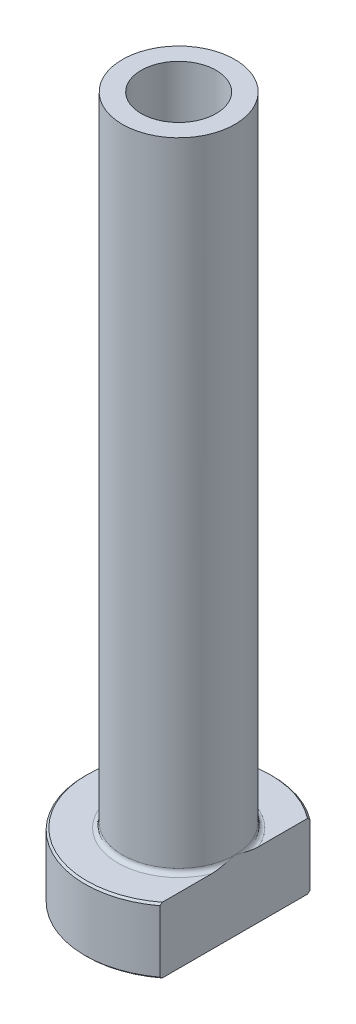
ISO-10303-21;
HEADER;
FILE_DESCRIPTION(('STEP AP214'),'2;1');
FILE_NAME('part.step','',(''),(''),'','','');
FILE_SCHEMA(('AUTOMOTIVE_DESIGN { 1 0 10303 214 1 1 1 1 }'));
ENDSEC;
DATA;
#1=APPLICATION_CONTEXT('core data for automotive mechanical design processes');
#2=APPLICATION_PROTOCOL_DEFINITION('international standard','automotive_design',2000,#1);
#3=PRODUCT_CONTEXT('',#1,'mechanical');
#4=PRODUCT('Part','Part','',(#3));
#5=PRODUCT_RELATED_PRODUCT_CATEGORY('part','',(#4));
#6=PRODUCT_DEFINITION_FORMATION('','',#4);
#7=PRODUCT_DEFINITION_CONTEXT('part definition',#1,'design');
#8=PRODUCT_DEFINITION('design','',#6,#7);
#9=PRODUCT_DEFINITION_SHAPE('','',#8);
#10=(LENGTH_UNIT() NAMED_UNIT(*) SI_UNIT(.MILLI.,.METRE.));
#11=(NAMED_UNIT(*) PLANE_ANGLE_UNIT() SI_UNIT($,.RADIAN.));
#12=(NAMED_UNIT(*) SI_UNIT($,.STERADIAN.) SOLID_ANGLE_UNIT());
#13=UNCERTAINTY_MEASURE_WITH_UNIT(LENGTH_MEASURE(1.E-05),#10,'distance_accuracy_value','');
#14=(GEOMETRIC_REPRESENTATION_CONTEXT(3) GLOBAL_UNCERTAINTY_ASSIGNED_CONTEXT((#13)) GLOBAL_UNIT_ASSIGNED_CONTEXT((#10,
#11,#12)) REPRESENTATION_CONTEXT('',''));
#15=CARTESIAN_POINT('',(0.,0.,0.));
#16=DIRECTION('',(0.,0.,1.));
#17=DIRECTION('',(1.,0.,0.));
#18=AXIS2_PLACEMENT_3D('',#15,#16,#17);
#19=CARTESIAN_POINT('',(0.,92.1876809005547,0.));
#20=DIRECTION('',(0.,1.,0.));
#21=DIRECTION('',(0.,0.,1.));
#22=AXIS2_PLACEMENT_3D('',#19,#20,#21);
#23=CYLINDRICAL_SURFACE('',#22,4.00000000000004);
#24=CARTESIAN_POINT('',(0.,75.,0.));
#25=DIRECTION('',(0.,1.,0.));
#26=DIRECTION('',(0.,0.,1.));
#27=AXIS2_PLACEMENT_3D('',#24,#25,#26);
#28=CIRCLE('',#27,4.00000000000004);
#29=CARTESIAN_POINT('',(0.,75.,4.00000000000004));
#30=VERTEX_POINT('',#29);
#31=EDGE_CURVE('E167',#30,#30,#28,.T.);
#32=ORIENTED_EDGE('',*,*,#31,.T.);
#33=EDGE_LOOP('',(#32));
#34=FACE_BOUND('',#33,.T.);
#35=CARTESIAN_POINT('',(0.,30.,0.));
#36=DIRECTION('',(0.,1.,0.));
#37=DIRECTION('',(0.,0.,1.));
#38=AXIS2_PLACEMENT_3D('',#35,#36,#37);
#39=CIRCLE('',#38,4.00000000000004);
#40=CARTESIAN_POINT('',(0.,30.,4.00000000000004));
#41=VERTEX_POINT('',#40);
#42=EDGE_CURVE('E170',#41,#41,#39,.T.);
#43=ORIENTED_EDGE('',*,*,#42,.F.);
#44=EDGE_LOOP('',(#43));
#45=FACE_BOUND('',#44,.T.);
#46=ADVANCED_FACE('F32',(#34,#45),#23,.F.);
#47=CARTESIAN_POINT('',(-4.00000000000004,75.,0.));
#48=DIRECTION('',(0.,1.,0.));
#49=DIRECTION('',(0.,0.,1.));
#50=AXIS2_PLACEMENT_3D('',#47,#48,#49);
#51=PLANE('',#50);
#52=CARTESIAN_POINT('',(0.,75.,0.));
#53=DIRECTION('',(0.,1.,0.));
#54=DIRECTION('',(0.,0.,1.));
#55=AXIS2_PLACEMENT_3D('',#52,#53,#54);
#56=CIRCLE('',#55,6.);
#57=CARTESIAN_POINT('',(0.,75.,6.));
#58=VERTEX_POINT('',#57);
#59=EDGE_CURVE('E174',#58,#58,#56,.T.);
#60=ORIENTED_EDGE('',*,*,#59,.T.);
#61=EDGE_LOOP('',(#60));
#62=FACE_BOUND('',#61,.T.);
#63=ORIENTED_EDGE('',*,*,#31,.F.);
#64=EDGE_LOOP('',(#63));
#65=FACE_BOUND('',#64,.T.);
#66=ADVANCED_FACE('F157',(#62,#65),#51,.T.);
#67=CARTESIAN_POINT('',(0.,92.1876809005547,0.));
#68=DIRECTION('',(0.,1.,0.));
#69=DIRECTION('',(0.,0.,1.));
#70=AXIS2_PLACEMENT_3D('',#67,#68,#69);
#71=CYLINDRICAL_SURFACE('',#70,5.99999999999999);
#72=CARTESIAN_POINT('',(0.,7.50000000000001,0.));
#73=DIRECTION('',(0.,1.,0.));
#74=DIRECTION('',(0.,0.,1.));
#75=AXIS2_PLACEMENT_3D('',#72,#73,#74);
#76=CIRCLE('',#75,5.99999999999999);
#77=CARTESIAN_POINT('',(5.99999999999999,7.50000000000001,0.));
#78=VERTEX_POINT('',#77);
#79=EDGE_CURVE('E180',#78,#78,#76,.T.);
#80=ORIENTED_EDGE('',*,*,#79,.T.);
#81=EDGE_LOOP('',(#80));
#82=FACE_BOUND('',#81,.T.);
#83=ORIENTED_EDGE('',*,*,#59,.F.);
#84=EDGE_LOOP('',(#83));
#85=FACE_BOUND('',#84,.T.);
#86=ADVANCED_FACE('F162',(#82,#85),#71,.T.);
#87=CARTESIAN_POINT('',(-5.99999999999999,7.,0.));
#88=DIRECTION('',(0.,1.,0.));
#89=DIRECTION('',(0.,0.,1.));
#90=AXIS2_PLACEMENT_3D('',#87,#88,#89);
#91=PLANE('',#90);
#92=DIRECTION('',(0.,0.,1.));
#93=VECTOR('',#92,1.);
#94=CARTESIAN_POINT('',(6.,7.,0.));
#95=LINE('',#94,#93);
#96=CARTESIAN_POINT('',(6.,7.,-7.74854825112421));
#97=VERTEX_POINT('',#96);
#98=CARTESIAN_POINT('',(6.,7.,-2.49999999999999));
#99=VERTEX_POINT('',#98);
#100=EDGE_CURVE('E54',#97,#99,#95,.T.);
#101=ORIENTED_EDGE('',*,*,#100,.F.);
#102=CARTESIAN_POINT('',(0.,7.,0.));
#103=DIRECTION('',(0.,1.,0.));
#104=DIRECTION('',(0.,0.,1.));
#105=AXIS2_PLACEMENT_3D('',#102,#103,#104);
#106=CIRCLE('',#105,9.8);
#107=CARTESIAN_POINT('',(5.99999999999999,7.,7.74854825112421));
#108=VERTEX_POINT('',#107);
#109=EDGE_CURVE('E186',#97,#108,#106,.T.);
#110=ORIENTED_EDGE('',*,*,#109,.T.);
#111=CARTESIAN_POINT('',(6.,7.,2.49999999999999));
#112=VERTEX_POINT('',#111);
#113=EDGE_CURVE('E134',#112,#108,#95,.T.);
#114=ORIENTED_EDGE('',*,*,#113,.F.);
#115=CARTESIAN_POINT('',(0.,7.,0.));
#116=DIRECTION('',(0.,1.,0.));
#117=DIRECTION('',(0.,0.,1.));
#118=AXIS2_PLACEMENT_3D('',#115,#116,#117);
#119=CIRCLE('',#118,6.49999999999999);
#120=EDGE_CURVE('E183',#112,#99,#119,.F.);
#121=ORIENTED_EDGE('',*,*,#120,.T.);
#122=EDGE_LOOP('',(#101,#110,#114,#121));
#123=FACE_BOUND('',#122,.T.);
#124=ADVANCED_FACE('F197',(#123),#91,.T.);
#125=CARTESIAN_POINT('',(0.,92.1876809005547,0.));
#126=DIRECTION('',(0.,1.,0.));
#127=DIRECTION('',(0.,0.,1.));
#128=AXIS2_PLACEMENT_3D('',#125,#126,#127);
#129=CYLINDRICAL_SURFACE('',#128,9.99999999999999);
#130=DIRECTION('',(0.,-1.,0.));
#131=VECTOR('',#130,1.);
#132=CARTESIAN_POINT('',(5.99999999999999,75.,7.99999999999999));
#133=LINE('',#132,#131);
#134=CARTESIAN_POINT('',(5.99999999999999,6.8,7.99999999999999));
#135=VERTEX_POINT('',#134);
#136=CARTESIAN_POINT('',(5.99999999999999,0.200000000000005,7.99999999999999));
#137=VERTEX_POINT('',#136);
#138=EDGE_CURVE('E82',#135,#137,#133,.T.);
#139=ORIENTED_EDGE('',*,*,#138,.F.);
#140=CARTESIAN_POINT('',(0.,6.8,0.));
#141=DIRECTION('',(0.,1.,0.));
#142=DIRECTION('',(0.,0.,1.));
#143=AXIS2_PLACEMENT_3D('',#140,#141,#142);
#144=CIRCLE('',#143,9.99999999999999);
#145=CARTESIAN_POINT('',(6.,6.8,-7.99999999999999));
#146=VERTEX_POINT('',#145);
#147=EDGE_CURVE('E95',#135,#146,#144,.F.);
#148=ORIENTED_EDGE('',*,*,#147,.T.);
#149=DIRECTION('',(0.,-1.,0.));
#150=VECTOR('',#149,1.);
#151=CARTESIAN_POINT('',(6.,75.,-7.99999999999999));
#152=LINE('',#151,#150);
#153=CARTESIAN_POINT('',(6.,0.200000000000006,-7.99999999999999));
#154=VERTEX_POINT('',#153);
#155=EDGE_CURVE('E192',#146,#154,#152,.T.);
#156=ORIENTED_EDGE('',*,*,#155,.T.);
#157=CARTESIAN_POINT('',(0.,0.200000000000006,0.));
#158=DIRECTION('',(0.,-1.,0.));
#159=DIRECTION('',(0.,0.,-1.));
#160=AXIS2_PLACEMENT_3D('',#157,#158,#159);
#161=CIRCLE('',#160,9.99999999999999);
#162=EDGE_CURVE('E98',#154,#137,#161,.F.);
#163=ORIENTED_EDGE('',*,*,#162,.T.);
#164=EDGE_LOOP('',(#139,#148,#156,#163));
#165=FACE_BOUND('',#164,.T.);
#166=ADVANCED_FACE('F190',(#165),#129,.T.);
#167=CARTESIAN_POINT('',(-9.99999999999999,0.,0.));
#168=DIRECTION('',(0.,-1.,0.));
#169=DIRECTION('',(0.,0.,-1.));
#170=AXIS2_PLACEMENT_3D('',#167,#168,#169);
#171=PLANE('',#170);
#172=CARTESIAN_POINT('',(0.,0.,0.));
#173=DIRECTION('',(0.,-1.,0.));
#174=DIRECTION('',(0.,0.,-1.));
#175=AXIS2_PLACEMENT_3D('',#172,#173,#174);
#176=CIRCLE('',#175,4.74999999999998);
#177=CARTESIAN_POINT('',(0.,0.,-4.74999999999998));
#178=VERTEX_POINT('',#177);
#179=EDGE_CURVE('E40',#178,#178,#176,.F.);
#180=ORIENTED_EDGE('',*,*,#179,.T.);
#181=EDGE_LOOP('',(#180));
#182=FACE_BOUND('',#181,.T.);
#183=DIRECTION('',(0.,0.,-1.));
#184=VECTOR('',#183,1.);
#185=CARTESIAN_POINT('',(5.99999999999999,0.,7.99999999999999));
#186=LINE('',#185,#184);
#187=CARTESIAN_POINT('',(5.99999999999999,0.,7.74854825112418));
#188=VERTEX_POINT('',#187);
#189=CARTESIAN_POINT('',(6.,0.,-7.74854825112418));
#190=VERTEX_POINT('',#189);
#191=EDGE_CURVE('E47',#188,#190,#186,.T.);
#192=ORIENTED_EDGE('',*,*,#191,.F.);
#193=CARTESIAN_POINT('',(0.,0.,0.));
#194=DIRECTION('',(0.,-1.,0.));
#195=DIRECTION('',(0.,0.,-1.));
#196=AXIS2_PLACEMENT_3D('',#193,#194,#195);
#197=CIRCLE('',#196,9.79999999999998);
#198=EDGE_CURVE('E92',#188,#190,#197,.T.);
#199=ORIENTED_EDGE('',*,*,#198,.T.);
#200=EDGE_LOOP('',(#192,#199));
#201=FACE_BOUND('',#200,.T.);
#202=ADVANCED_FACE('F91',(#182,#201),#171,.T.);
#203=CARTESIAN_POINT('',(0.,92.1876809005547,0.));
#204=DIRECTION('',(0.,1.,0.));
#205=DIRECTION('',(0.,0.,1.));
#206=AXIS2_PLACEMENT_3D('',#203,#204,#205);
#207=CYLINDRICAL_SURFACE('',#206,4.24999999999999);
#208=CARTESIAN_POINT('',(0.,0.499999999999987,0.));
#209=DIRECTION('',(0.,-1.,0.));
#210=DIRECTION('',(0.,0.,-1.));
#211=AXIS2_PLACEMENT_3D('',#208,#209,#210);
#212=CIRCLE('',#211,4.24999999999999);
#213=CARTESIAN_POINT('',(0.,0.499999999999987,-4.24999999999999));
#214=VERTEX_POINT('',#213);
#215=EDGE_CURVE('E11',#214,#214,#212,.T.);
#216=ORIENTED_EDGE('',*,*,#215,.T.);
#217=EDGE_LOOP('',(#216));
#218=FACE_BOUND('',#217,.T.);
#219=CARTESIAN_POINT('',(0.,18.,0.));
#220=DIRECTION('',(0.,1.,0.));
#221=DIRECTION('',(0.,0.,1.));
#222=AXIS2_PLACEMENT_3D('',#219,#220,#221);
#223=CIRCLE('',#222,4.24999999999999);
#224=CARTESIAN_POINT('',(0.,18.,4.24999999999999));
#225=VERTEX_POINT('',#224);
#226=EDGE_CURVE('E172',#225,#225,#223,.T.);
#227=ORIENTED_EDGE('',*,*,#226,.T.);
#228=EDGE_LOOP('',(#227));
#229=FACE_BOUND('',#228,.T.);
#230=ADVANCED_FACE('F215',(#218,#229),#207,.F.);
#231=CARTESIAN_POINT('',(0.,18.,0.));
#232=DIRECTION('',(0.,-1.,0.));
#233=DIRECTION('',(0.,0.,-1.));
#234=AXIS2_PLACEMENT_3D('',#231,#232,#233);
#235=CONICAL_SURFACE('',#234,4.24999999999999,0.0208303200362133);
#236=ORIENTED_EDGE('',*,*,#42,.T.);
#237=EDGE_LOOP('',(#236));
#238=FACE_BOUND('',#237,.T.);
#239=ORIENTED_EDGE('',*,*,#226,.F.);
#240=EDGE_LOOP('',(#239));
#241=FACE_BOUND('',#240,.T.);
#242=ADVANCED_FACE('F111',(#238,#241),#235,.F.);
#243=CARTESIAN_POINT('',(0.,7.50000000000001,0.));
#244=DIRECTION('',(0.,1.,0.));
#245=DIRECTION('',(0.,0.,1.));
#246=AXIS2_PLACEMENT_3D('',#243,#244,#245);
#247=TOROIDAL_SURFACE('',#246,6.49999999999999,0.5);
#248=ORIENTED_EDGE('',*,*,#120,.F.);
#249=CARTESIAN_POINT('',(5.99999999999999,7.50000000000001,0.));
#250=CARTESIAN_POINT('',(5.99999999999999,7.50000080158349,6.70442402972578E-11));
#251=CARTESIAN_POINT('',(5.99999999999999,7.50000160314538,2.62462545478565E-07));
#252=CARTESIAN_POINT('',(5.99999999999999,7.50000311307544,1.01907161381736E-06));
#253=CARTESIAN_POINT('',(5.99999999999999,7.50000381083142,1.52837897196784E-06));
#254=CARTESIAN_POINT('',(5.99999999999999,7.50000523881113,2.74467568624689E-06));
#255=CARTESIAN_POINT('',(5.99999999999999,7.50000595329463,3.47066670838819E-06));
#256=CARTESIAN_POINT('',(5.99999999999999,7.50000725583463,4.99336121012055E-06));
#257=CARTESIAN_POINT('',(5.99999999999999,7.50000784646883,5.7880006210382E-06));
#258=CARTESIAN_POINT('',(5.99999999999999,7.5000099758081,8.79661487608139E-06));
#259=CARTESIAN_POINT('',(5.99999999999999,7.5000113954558,1.10980660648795E-05));
#260=CARTESIAN_POINT('',(5.99999999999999,7.50001378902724,1.57116080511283E-05));
#261=CARTESIAN_POINT('',(5.99999999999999,7.50001478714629,1.80117429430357E-05));
#262=CARTESIAN_POINT('',(5.99999999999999,7.50001885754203,2.75423816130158E-05));
#263=CARTESIAN_POINT('',(5.99999999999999,7.50002181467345,3.48285051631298E-05));
#264=CARTESIAN_POINT('',(5.99999999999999,7.50002628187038,4.87408364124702E-05));
#265=CARTESIAN_POINT('',(5.99999999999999,7.50002793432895,5.53214351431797E-05));
#266=CARTESIAN_POINT('',(5.99999999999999,7.50003978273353,0.000103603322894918));
#267=CARTESIAN_POINT('',(6.,7.50004857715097,0.000145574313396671));
#268=CARTESIAN_POINT('',(6.,7.50008704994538,0.000310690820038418));
#269=CARTESIAN_POINT('',(6.,7.50012394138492,0.000432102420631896));
#270=CARTESIAN_POINT('',(5.99999999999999,7.50026686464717,0.000911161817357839));
#271=CARTESIAN_POINT('',(5.99999999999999,7.50036807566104,0.0012698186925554));
#272=CARTESIAN_POINT('',(6.,7.50077195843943,0.00268961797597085));
#273=CARTESIAN_POINT('',(6.,7.50108058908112,0.0037494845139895));
#274=CARTESIAN_POINT('',(5.99999999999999,7.50236320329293,0.00816658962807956));
#275=CARTESIAN_POINT('',(5.99999999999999,7.50332976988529,0.0115254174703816));
#276=CARTESIAN_POINT('',(6.00000000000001,7.51709821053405,0.0593544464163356));
#277=CARTESIAN_POINT('',(6.,7.52995465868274,0.103813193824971));
#278=CARTESIAN_POINT('',(5.99999999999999,7.55506029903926,0.190977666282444));
#279=CARTESIAN_POINT('',(5.99999999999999,7.56731321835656,0.233682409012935));
#280=CARTESIAN_POINT('',(6.,7.5932566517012,0.324512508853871));
#281=CARTESIAN_POINT('',(6.,7.60693346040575,0.372641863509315));
#282=CARTESIAN_POINT('',(6.,7.63422038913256,0.469489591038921));
#283=CARTESIAN_POINT('',(6.,7.64782813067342,0.518208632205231));
#284=CARTESIAN_POINT('',(6.,7.68043734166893,0.636338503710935));
#285=CARTESIAN_POINT('',(6.,7.69928754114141,0.705791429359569));
#286=CARTESIAN_POINT('',(6.,7.73566887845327,0.84310273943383));
#287=CARTESIAN_POINT('',(6.,7.75322160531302,0.910955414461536));
#288=CARTESIAN_POINT('',(6.,7.80024878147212,1.0985743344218));
#289=CARTESIAN_POINT('',(6.,7.8286490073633,1.21861610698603));
#290=CARTESIAN_POINT('',(6.,7.88105633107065,1.46081534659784));
#291=CARTESIAN_POINT('',(6.,7.90502088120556,1.58298212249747));
#292=CARTESIAN_POINT('',(6.,7.94810499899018,1.83866408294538));
#293=CARTESIAN_POINT('',(6.,7.96665856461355,1.97228081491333));
#294=CARTESIAN_POINT('',(6.,7.98621697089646,2.17329578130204));
#295=CARTESIAN_POINT('',(6.,7.99135613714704,2.24029152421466));
#296=CARTESIAN_POINT('',(6.,7.99832928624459,2.37444824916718));
#297=CARTESIAN_POINT('',(6.,8.00016429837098,2.44160917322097));
#298=CARTESIAN_POINT('',(6.,7.99984674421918,2.56298631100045));
#299=CARTESIAN_POINT('',(6.,7.99839439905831,2.61720324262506));
#300=CARTESIAN_POINT('',(6.,7.99236557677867,2.72552036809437));
#301=CARTESIAN_POINT('',(6.,7.98778645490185,2.77962042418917));
#302=CARTESIAN_POINT('',(6.,7.97492915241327,2.88664710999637));
#303=CARTESIAN_POINT('',(6.,7.9667026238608,2.93957965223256));
#304=CARTESIAN_POINT('',(6.,7.94570253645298,3.04448333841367));
#305=CARTESIAN_POINT('',(6.,7.93293488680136,3.09645563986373));
#306=CARTESIAN_POINT('',(6.,7.90135968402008,3.19943606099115));
#307=CARTESIAN_POINT('',(6.,7.88247175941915,3.25042120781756));
#308=CARTESIAN_POINT('',(6.,7.84818685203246,3.32403783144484));
#309=CARTESIAN_POINT('',(6.,7.83579052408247,3.34806431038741));
#310=CARTESIAN_POINT('',(6.,7.80866016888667,3.39474488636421));
#311=CARTESIAN_POINT('',(6.,7.79392968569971,3.41740099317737));
#312=CARTESIAN_POINT('',(6.,7.76577135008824,3.45524173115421));
#313=CARTESIAN_POINT('',(6.,7.75294719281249,3.47087266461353));
#314=CARTESIAN_POINT('',(6.,7.7255631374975,3.50058040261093));
#315=CARTESIAN_POINT('',(6.,7.71100204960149,3.51465612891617));
#316=CARTESIAN_POINT('',(6.,7.67984897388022,3.54077006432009));
#317=CARTESIAN_POINT('',(6.,7.66323651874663,3.55278430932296));
#318=CARTESIAN_POINT('',(6.,7.62815222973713,3.57370259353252));
#319=CARTESIAN_POINT('',(6.,7.60968501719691,3.58261412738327));
#320=CARTESIAN_POINT('',(6.,7.57639898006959,3.59454653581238));
#321=CARTESIAN_POINT('',(6.,7.56191673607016,3.59850385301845));
#322=CARTESIAN_POINT('',(6.,7.53249228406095,3.60392336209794));
#323=CARTESIAN_POINT('',(6.,7.5175504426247,3.60538749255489));
#324=CARTESIAN_POINT('',(6.,7.48761833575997,3.60568912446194));
#325=CARTESIAN_POINT('',(6.,7.47262803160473,3.6045228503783));
#326=CARTESIAN_POINT('',(6.,7.44306278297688,3.59966500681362));
#327=CARTESIAN_POINT('',(6.,7.42848812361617,3.59597174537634));
#328=CARTESIAN_POINT('',(6.,7.39702156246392,3.58531109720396));
#329=CARTESIAN_POINT('',(6.,7.38031267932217,3.57780732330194));
#330=CARTESIAN_POINT('',(6.,7.34834450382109,3.56018434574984));
#331=CARTESIAN_POINT('',(6.,7.33308764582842,3.55006085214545));
#332=CARTESIAN_POINT('',(6.,7.29715308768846,3.52252389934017));
#333=CARTESIAN_POINT('',(6.,7.27737832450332,3.50394102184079));
#334=CARTESIAN_POINT('',(6.,7.24088410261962,3.46399503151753));
#335=CARTESIAN_POINT('',(6.,7.22417302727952,3.44262455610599));
#336=CARTESIAN_POINT('',(6.,7.18148338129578,3.38088102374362));
#337=CARTESIAN_POINT('',(6.,7.15831783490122,3.33858120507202));
#338=CARTESIAN_POINT('',(6.,7.11822747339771,3.25128083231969));
#339=CARTESIAN_POINT('',(6.,7.10130560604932,3.20627901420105));
#340=CARTESIAN_POINT('',(6.,7.0719338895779,3.11375892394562));
#341=CARTESIAN_POINT('',(6.,7.05959256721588,3.06620687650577));
#342=CARTESIAN_POINT('',(6.,7.03888782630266,2.97022063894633));
#343=CARTESIAN_POINT('',(6.,7.03052890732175,2.92178551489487));
#344=CARTESIAN_POINT('',(6.,7.01697563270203,2.82374574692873));
#345=CARTESIAN_POINT('',(6.,7.01183067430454,2.77413446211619));
#346=CARTESIAN_POINT('',(6.,7.00435015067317,2.67475263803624));
#347=CARTESIAN_POINT('',(6.,7.00201229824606,2.62498226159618));
#348=CARTESIAN_POINT('',(6.,6.99897190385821,2.49377014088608));
#349=CARTESIAN_POINT('',(6.,7.00025005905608,2.41228296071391));
#350=CARTESIAN_POINT('',(6.,7.00775652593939,2.2495213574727));
#351=CARTESIAN_POINT('',(6.,7.01398784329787,2.16824709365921));
#352=CARTESIAN_POINT('',(6.,7.03045087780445,2.00575531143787));
#353=CARTESIAN_POINT('',(6.,7.04070001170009,1.92453960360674));
#354=CARTESIAN_POINT('',(6.,7.06442774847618,1.76257601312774));
#355=CARTESIAN_POINT('',(6.,7.07790697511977,1.68182822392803));
#356=CARTESIAN_POINT('',(6.,7.11973611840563,1.45394312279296));
#357=CARTESIAN_POINT('',(6.,7.151138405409,1.30736987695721));
#358=CARTESIAN_POINT('',(6.,7.21927147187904,1.01717316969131));
#359=CARTESIAN_POINT('',(6.,7.25594155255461,0.873534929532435));
#360=CARTESIAN_POINT('',(6.,7.30765759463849,0.680321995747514));
#361=CARTESIAN_POINT('',(6.,7.32124979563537,0.63035125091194));
#362=CARTESIAN_POINT('',(6.,7.34913735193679,0.529103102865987));
#363=CARTESIAN_POINT('',(6.,7.36344174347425,0.477828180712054));
#364=CARTESIAN_POINT('',(6.,7.38809313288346,0.390268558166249));
#365=CARTESIAN_POINT('',(6.,7.39837954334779,0.353966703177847));
#366=CARTESIAN_POINT('',(6.,7.41893445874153,0.281778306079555));
#367=CARTESIAN_POINT('',(6.,7.42920197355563,0.245891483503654));
#368=CARTESIAN_POINT('',(5.99999999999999,7.44864004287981,0.178137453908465));
#369=CARTESIAN_POINT('',(5.99999999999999,7.4578051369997,0.14626862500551));
#370=CARTESIAN_POINT('',(6.,7.47656016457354,0.081230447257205));
#371=CARTESIAN_POINT('',(6.,7.48615204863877,0.0480615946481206));
#372=CARTESIAN_POINT('',(5.99999999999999,7.4966696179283,0.0115277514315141));
#373=CARTESIAN_POINT('',(5.99999999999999,7.49763547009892,0.00817123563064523));
#374=CARTESIAN_POINT('',(6.,7.49891791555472,0.00375466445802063));
#375=CARTESIAN_POINT('',(6.,7.49922706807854,0.00269301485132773));
#376=CARTESIAN_POINT('',(5.99999999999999,7.49963158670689,0.0012709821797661));
#377=CARTESIAN_POINT('',(5.99999999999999,7.49973292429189,0.000911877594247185));
#378=CARTESIAN_POINT('',(6.,7.49987600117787,0.000432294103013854));
#379=CARTESIAN_POINT('',(6.,7.49991291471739,0.000310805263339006));
#380=CARTESIAN_POINT('',(6.,7.49995140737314,0.000145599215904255));
#381=CARTESIAN_POINT('',(5.99999999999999,7.49996020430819,0.000103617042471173));
#382=CARTESIAN_POINT('',(5.99999999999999,7.4999720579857,5.53238180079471E-05));
#383=CARTESIAN_POINT('',(5.99999999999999,7.49997371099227,4.87425652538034E-05));
#384=CARTESIAN_POINT('',(5.99999999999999,7.4999781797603,3.48289219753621E-05));
#385=CARTESIAN_POINT('',(5.99999999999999,7.49998113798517,2.75421746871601E-05));
#386=CARTESIAN_POINT('',(5.99999999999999,7.49998520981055,1.80108993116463E-05));
#387=CARTESIAN_POINT('',(5.99999999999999,7.49998620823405,1.57107152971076E-05));
#388=CARTESIAN_POINT('',(5.99999999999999,7.4999886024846,1.10971279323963E-05));
#389=CARTESIAN_POINT('',(5.99999999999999,7.49999002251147,8.79568601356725E-06));
#390=CARTESIAN_POINT('',(5.99999999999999,7.49999215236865,5.78714663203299E-06));
#391=CARTESIAN_POINT('',(5.99999999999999,7.49999274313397,4.99254313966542E-06));
#392=CARTESIAN_POINT('',(5.99999999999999,7.49999404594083,3.469944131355E-06));
#393=CARTESIAN_POINT('',(5.99999999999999,7.4999947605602,2.74401334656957E-06));
#394=CARTESIAN_POINT('',(5.99999999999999,7.49999618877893,1.52785958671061E-06));
#395=CARTESIAN_POINT('',(5.99999999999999,7.4999968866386,1.01863013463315E-06));
#396=CARTESIAN_POINT('',(5.99999999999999,7.49999839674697,2.62215463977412E-07));
#397=CARTESIAN_POINT('',(5.99999999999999,7.49999919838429,-6.70456352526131E-11));
#398=CARTESIAN_POINT('',(5.99999999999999,7.50000000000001,0.));
#399=B_SPLINE_CURVE_WITH_KNOTS('',3,(#249,#250,#251,#252,#253,#254,#255,#256,#257,#258,#259,
#260,#261,#262,#263,#264,#265,#266,#267,#268,#269,#270,#271,#272,#273,#274,#275,#276,#277,#278,
#279,#280,#281,#282,#283,#284,#285,#286,#287,#288,#289,#290,#291,#292,#293,#294,#295,#296,#297,
#298,#299,#300,#301,#302,#303,#304,#305,#306,#307,#308,#309,#310,#311,#312,#313,#314,#315,#316,
#317,#318,#319,#320,#321,#322,#323,#324,#325,#326,#327,#328,#329,#330,#331,#332,#333,#334,#335,
#336,#337,#338,#339,#340,#341,#342,#343,#344,#345,#346,#347,#348,#349,#350,#351,#352,#353,#354,
#355,#356,#357,#358,#359,#360,#361,#362,#363,#364,#365,#366,#367,#368,#369,#370,#371,#372,#373,
#374,#375,#376,#377,#378,#379,#380,#381,#382,#383,#384,#385,#386,#387,#388,#389,#390,#391,#392,
#393,#394,#395,#396,#397,#398),.UNSPECIFIED.,.T.,.F.,(4,2,2,2,2,2,2,2,2,2,2,2,2,2,2,2,2,2,2,2,2,
2,2,2,2,2,2,2,2,2,2,2,2,2,2,2,2,2,2,2,2,2,2,2,2,2,2,2,2,2,2,2,2,2,2,2,2,2,2,2,2,2,2,2,2,2,2,2,2,
2,2,2,2,2,4),(0.,2.41533119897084E-06,5.00162276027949E-06,8.04116595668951E-06,
1.10092393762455E-05,1.90889834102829E-05,2.66047491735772E-05,5.01454192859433E-05,
7.04740172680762E-05,0.000199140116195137,0.000579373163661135,0.00169781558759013,
0.00500893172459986,0.0154949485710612,0.154330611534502,0.287615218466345,0.437719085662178,
0.589470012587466,0.805361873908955,1.01561737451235,1.38561400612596,1.75899405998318,
2.1633128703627,2.36482907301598,2.56628249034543,2.72891861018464,2.89169246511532,
3.05223140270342,3.21256219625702,3.37509011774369,3.4560997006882,3.53698744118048,
3.59753760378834,3.65812948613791,3.71938396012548,3.78048942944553,3.82533702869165,
3.87014974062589,3.9150268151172,3.95993396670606,4.01458097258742,4.06931803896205,
4.15026803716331,4.23143634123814,4.37530581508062,4.51924312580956,4.66640085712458,
4.81372446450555,4.96325999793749,5.11267360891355,5.3569517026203,5.60137814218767,
5.84687607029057,6.0924214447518,6.54191534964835,6.98659302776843,7.14195169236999,
7.30164895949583,7.41484221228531,7.52682205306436,7.62630458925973,7.72988447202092,
7.74036324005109,7.74367992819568,7.74479976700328,7.74518024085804,7.74530894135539,
7.74532927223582,7.74535281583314,7.74536033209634,7.74536841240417,7.74537138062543,
7.74537442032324,7.74537700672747,7.74537942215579),.UNSPECIFIED.);
#400=EDGE_CURVE('E126',#112,#78,#399,.T.);
#401=ORIENTED_EDGE('',*,*,#400,.T.);
#402=ORIENTED_EDGE('',*,*,#79,.F.);
#403=CARTESIAN_POINT('',(5.99999999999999,7.50000000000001,0.));
#404=CARTESIAN_POINT('',(5.99999999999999,7.49999919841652,-6.70428914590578E-11));
#405=CARTESIAN_POINT('',(5.99999999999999,7.49999839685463,-2.62462544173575E-07));
#406=CARTESIAN_POINT('',(5.99999999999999,7.49999688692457,-1.01907161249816E-06));
#407=CARTESIAN_POINT('',(5.99999999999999,7.49999618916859,-1.52837897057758E-06));
#408=CARTESIAN_POINT('',(5.99999999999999,7.49999476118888,-2.74467568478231E-06));
#409=CARTESIAN_POINT('',(5.99999999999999,7.49999404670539,-3.47066670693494E-06));
#410=CARTESIAN_POINT('',(5.99999999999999,7.49999274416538,-4.9933612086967E-06));
#411=CARTESIAN_POINT('',(5.99999999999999,7.49999215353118,-5.78800061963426E-06));
#412=CARTESIAN_POINT('',(5.99999999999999,7.49999002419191,-8.79661487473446E-06));
#413=CARTESIAN_POINT('',(5.99999999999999,7.49998860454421,-1.10980660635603E-05));
#414=CARTESIAN_POINT('',(5.99999999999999,7.49998621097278,-1.57116080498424E-05));
#415=CARTESIAN_POINT('',(5.99999999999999,7.49998521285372,-1.80117429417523E-05));
#416=CARTESIAN_POINT('',(5.99999999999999,7.49998114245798,-2.7542381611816E-05));
#417=CARTESIAN_POINT('',(5.99999999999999,7.49997818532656,-3.48285051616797E-05));
#418=CARTESIAN_POINT('',(5.99999999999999,7.49997371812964,-4.87408364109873E-05));
#419=CARTESIAN_POINT('',(5.99999999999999,7.49997206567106,-5.53214351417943E-05));
#420=CARTESIAN_POINT('',(5.99999999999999,7.49996021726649,-0.000103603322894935));
#421=CARTESIAN_POINT('',(6.,7.49995142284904,-0.000145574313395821));
#422=CARTESIAN_POINT('',(6.,7.49991295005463,-0.000310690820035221));
#423=CARTESIAN_POINT('',(6.,7.49987605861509,-0.000432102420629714));
#424=CARTESIAN_POINT('',(5.99999999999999,7.49973313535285,-0.000911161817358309));
#425=CARTESIAN_POINT('',(5.99999999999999,7.49963192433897,-0.00126981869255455));
#426=CARTESIAN_POINT('',(6.,7.49922804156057,-0.00268961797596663));
#427=CARTESIAN_POINT('',(6.,7.49891941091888,-0.0037494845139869));
#428=CARTESIAN_POINT('',(5.99999999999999,7.49763679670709,-0.00816658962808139));
#429=CARTESIAN_POINT('',(5.99999999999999,7.49667023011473,-0.0115254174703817));
#430=CARTESIAN_POINT('',(6.00000000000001,7.48290178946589,-0.0593544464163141));
#431=CARTESIAN_POINT('',(6.,7.47004534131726,-0.103813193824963));
#432=CARTESIAN_POINT('',(5.99999999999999,7.44493970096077,-0.190977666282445));
#433=CARTESIAN_POINT('',(5.99999999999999,7.43268678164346,-0.233682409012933));
#434=CARTESIAN_POINT('',(6.,7.40674334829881,-0.324512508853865));
#435=CARTESIAN_POINT('',(6.,7.39306653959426,-0.372641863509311));
#436=CARTESIAN_POINT('',(6.,7.36577961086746,-0.469489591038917));
#437=CARTESIAN_POINT('',(6.,7.35217186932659,-0.518208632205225));
#438=CARTESIAN_POINT('',(6.,7.31956265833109,-0.636338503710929));
#439=CARTESIAN_POINT('',(6.,7.3007124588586,-0.705791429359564));
#440=CARTESIAN_POINT('',(6.,7.26433112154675,-0.843102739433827));
#441=CARTESIAN_POINT('',(6.,7.246778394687,-0.910955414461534));
#442=CARTESIAN_POINT('',(6.,7.1997512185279,-1.0985743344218));
#443=CARTESIAN_POINT('',(6.,7.17135099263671,-1.21861610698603));
#444=CARTESIAN_POINT('',(6.,7.11894366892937,-1.46081534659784));
#445=CARTESIAN_POINT('',(6.,7.09497911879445,-1.58298212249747));
#446=CARTESIAN_POINT('',(6.,7.05189500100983,-1.83866408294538));
#447=CARTESIAN_POINT('',(6.,7.03334143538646,-1.97228081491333));
#448=CARTESIAN_POINT('',(6.,7.01378302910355,-2.17329578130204));
#449=CARTESIAN_POINT('',(6.,7.00864386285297,-2.24029152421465));
#450=CARTESIAN_POINT('',(6.,7.00167071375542,-2.37444824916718));
#451=CARTESIAN_POINT('',(6.,6.99983570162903,-2.44160917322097));
#452=CARTESIAN_POINT('',(6.,7.00015325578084,-2.56298631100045));
#453=CARTESIAN_POINT('',(6.,7.00160560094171,-2.61720324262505));
#454=CARTESIAN_POINT('',(6.,7.00763442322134,-2.72552036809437));
#455=CARTESIAN_POINT('',(6.,7.01221354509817,-2.77962042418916));
#456=CARTESIAN_POINT('',(6.,7.02507084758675,-2.88664710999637));
#457=CARTESIAN_POINT('',(6.,7.03329737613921,-2.93957965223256));
#458=CARTESIAN_POINT('',(6.,7.05429746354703,-3.04448333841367));
#459=CARTESIAN_POINT('',(6.,7.06706511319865,-3.09645563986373));
#460=CARTESIAN_POINT('',(6.,7.09864031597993,-3.19943606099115));
#461=CARTESIAN_POINT('',(6.,7.11752824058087,-3.25042120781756));
#462=CARTESIAN_POINT('',(6.,7.15181314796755,-3.32403783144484));
#463=CARTESIAN_POINT('',(6.,7.16420947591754,-3.34806431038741));
#464=CARTESIAN_POINT('',(6.,7.19133983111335,-3.39474488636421));
#465=CARTESIAN_POINT('',(6.,7.2060703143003,-3.41740099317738));
#466=CARTESIAN_POINT('',(6.,7.23422864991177,-3.45524173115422));
#467=CARTESIAN_POINT('',(6.,7.24705280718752,-3.47087266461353));
#468=CARTESIAN_POINT('',(6.,7.27443686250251,-3.50058040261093));
#469=CARTESIAN_POINT('',(6.,7.28899795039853,-3.51465612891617));
#470=CARTESIAN_POINT('',(6.,7.32015102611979,-3.54077006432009));
#471=CARTESIAN_POINT('',(6.,7.33676348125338,-3.55278430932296));
#472=CARTESIAN_POINT('',(6.,7.37184777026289,-3.57370259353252));
#473=CARTESIAN_POINT('',(6.,7.3903149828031,-3.58261412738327));
#474=CARTESIAN_POINT('',(6.,7.42360101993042,-3.59454653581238));
#475=CARTESIAN_POINT('',(6.,7.43808326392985,-3.59850385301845));
#476=CARTESIAN_POINT('',(6.,7.46750771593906,-3.60392336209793));
#477=CARTESIAN_POINT('',(6.,7.48244955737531,-3.60538749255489));
#478=CARTESIAN_POINT('',(6.,7.51238166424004,-3.60568912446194));
#479=CARTESIAN_POINT('',(6.,7.52737196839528,-3.6045228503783));
#480=CARTESIAN_POINT('',(6.,7.55693721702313,-3.59966500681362));
#481=CARTESIAN_POINT('',(6.,7.57151187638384,-3.59597174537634));
#482=CARTESIAN_POINT('',(6.,7.60297843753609,-3.58531109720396));
#483=CARTESIAN_POINT('',(6.,7.61968732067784,-3.57780732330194));
#484=CARTESIAN_POINT('',(6.,7.65165549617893,-3.56018434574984));
#485=CARTESIAN_POINT('',(6.,7.6669123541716,-3.55006085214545));
#486=CARTESIAN_POINT('',(6.,7.70284691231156,-3.52252389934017));
#487=CARTESIAN_POINT('',(6.,7.72262167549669,-3.50394102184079));
#488=CARTESIAN_POINT('',(6.,7.7591158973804,-3.46399503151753));
#489=CARTESIAN_POINT('',(6.,7.77582697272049,-3.44262455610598));
#490=CARTESIAN_POINT('',(6.,7.81851661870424,-3.38088102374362));
#491=CARTESIAN_POINT('',(6.,7.8416821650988,-3.33858120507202));
#492=CARTESIAN_POINT('',(6.,7.8817725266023,-3.25128083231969));
#493=CARTESIAN_POINT('',(6.,7.8986943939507,-3.20627901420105));
#494=CARTESIAN_POINT('',(6.,7.92806611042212,-3.11375892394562));
#495=CARTESIAN_POINT('',(6.,7.94040743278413,-3.06620687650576));
#496=CARTESIAN_POINT('',(6.,7.96111217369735,-2.97022063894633));
#497=CARTESIAN_POINT('',(6.,7.96947109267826,-2.92178551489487));
#498=CARTESIAN_POINT('',(6.,7.98302436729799,-2.82374574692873));
#499=CARTESIAN_POINT('',(6.,7.98816932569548,-2.77413446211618));
#500=CARTESIAN_POINT('',(6.,7.99564984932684,-2.67475263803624));
#501=CARTESIAN_POINT('',(6.,7.99798770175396,-2.62498226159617));
#502=CARTESIAN_POINT('',(6.,8.00102809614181,-2.49377014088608));
#503=CARTESIAN_POINT('',(6.,7.99974994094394,-2.4122829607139));
#504=CARTESIAN_POINT('',(6.,7.99224347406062,-2.24952135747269));
#505=CARTESIAN_POINT('',(6.,7.98601215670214,-2.1682470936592));
#506=CARTESIAN_POINT('',(6.,7.96954912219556,-2.00575531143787));
#507=CARTESIAN_POINT('',(6.,7.95929998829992,-1.92453960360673));
#508=CARTESIAN_POINT('',(6.,7.93557225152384,-1.76257601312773));
#509=CARTESIAN_POINT('',(6.,7.92209302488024,-1.68182822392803));
#510=CARTESIAN_POINT('',(6.,7.88026388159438,-1.45394312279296));
#511=CARTESIAN_POINT('',(6.,7.84886159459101,-1.3073698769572));
#512=CARTESIAN_POINT('',(6.,7.78072852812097,-1.0171731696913));
#513=CARTESIAN_POINT('',(6.,7.74405844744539,-0.873534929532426));
#514=CARTESIAN_POINT('',(6.,7.69234240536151,-0.680321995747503));
#515=CARTESIAN_POINT('',(6.,7.67875020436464,-0.630351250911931));
#516=CARTESIAN_POINT('',(6.,7.65086264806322,-0.52910310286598));
#517=CARTESIAN_POINT('',(6.,7.63655825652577,-0.477828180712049));
#518=CARTESIAN_POINT('',(6.,7.61190686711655,-0.390268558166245));
#519=CARTESIAN_POINT('',(6.,7.60162045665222,-0.353966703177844));
#520=CARTESIAN_POINT('',(6.,7.58106554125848,-0.281778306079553));
#521=CARTESIAN_POINT('',(6.,7.57079802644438,-0.245891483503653));
#522=CARTESIAN_POINT('',(5.99999999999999,7.55135995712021,-0.178137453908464));
#523=CARTESIAN_POINT('',(5.99999999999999,7.54219486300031,-0.146268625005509));
#524=CARTESIAN_POINT('',(6.,7.52343983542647,-0.0812304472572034));
#525=CARTESIAN_POINT('',(6.,7.51384795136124,-0.0480615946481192));
#526=CARTESIAN_POINT('',(5.99999999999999,7.50333038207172,-0.0115277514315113));
#527=CARTESIAN_POINT('',(5.99999999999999,7.5023645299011,-0.00817123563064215));
#528=CARTESIAN_POINT('',(6.,7.50108208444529,-0.00375466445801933));
#529=CARTESIAN_POINT('',(6.,7.50077293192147,-0.00269301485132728));
#530=CARTESIAN_POINT('',(5.99999999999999,7.50036841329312,-0.00127098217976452));
#531=CARTESIAN_POINT('',(5.99999999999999,7.50026707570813,-0.000911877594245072));
#532=CARTESIAN_POINT('',(6.,7.50012399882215,-0.000432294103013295));
#533=CARTESIAN_POINT('',(6.,7.50008708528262,-0.000310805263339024));
#534=CARTESIAN_POINT('',(6.,7.50004859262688,-0.000145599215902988));
#535=CARTESIAN_POINT('',(5.99999999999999,7.50003979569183,-0.000103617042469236));
#536=CARTESIAN_POINT('',(5.99999999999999,7.50002794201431,-5.53238180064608E-05));
#537=CARTESIAN_POINT('',(5.99999999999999,7.50002628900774,-4.8742565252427E-05));
#538=CARTESIAN_POINT('',(5.99999999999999,7.50002182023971,-3.48289219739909E-05));
#539=CARTESIAN_POINT('',(5.99999999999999,7.50001886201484,-2.75421746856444E-05));
#540=CARTESIAN_POINT('',(5.99999999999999,7.50001479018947,-1.80108993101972E-05));
#541=CARTESIAN_POINT('',(5.99999999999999,7.50001379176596,-1.57107152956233E-05));
#542=CARTESIAN_POINT('',(5.99999999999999,7.50001139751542,-1.10971279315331E-05));
#543=CARTESIAN_POINT('',(5.99999999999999,7.50000997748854,-8.79568601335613E-06));
#544=CARTESIAN_POINT('',(5.99999999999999,7.50000784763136,-5.78714663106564E-06));
#545=CARTESIAN_POINT('',(5.99999999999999,7.50000725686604,-4.99254313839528E-06));
#546=CARTESIAN_POINT('',(5.99999999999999,7.50000595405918,-3.46994412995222E-06));
#547=CARTESIAN_POINT('',(5.99999999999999,7.50000523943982,-2.74401334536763E-06));
#548=CARTESIAN_POINT('',(5.99999999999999,7.50000381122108,-1.52785958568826E-06));
#549=CARTESIAN_POINT('',(5.99999999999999,7.50000311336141,-1.01863013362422E-06));
#550=CARTESIAN_POINT('',(5.99999999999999,7.50000160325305,-2.62215462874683E-07));
#551=CARTESIAN_POINT('',(5.99999999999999,7.50000080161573,6.70468884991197E-11));
#552=CARTESIAN_POINT('',(5.99999999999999,7.50000000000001,0.));
#553=B_SPLINE_CURVE_WITH_KNOTS('',3,(#403,#404,#405,#406,#407,#408,#409,#410,#411,#412,#413,
#414,#415,#416,#417,#418,#419,#420,#421,#422,#423,#424,#425,#426,#427,#428,#429,#430,#431,#432,
#433,#434,#435,#436,#437,#438,#439,#440,#441,#442,#443,#444,#445,#446,#447,#448,#449,#450,#451,
#452,#453,#454,#455,#456,#457,#458,#459,#460,#461,#462,#463,#464,#465,#466,#467,#468,#469,#470,
#471,#472,#473,#474,#475,#476,#477,#478,#479,#480,#481,#482,#483,#484,#485,#486,#487,#488,#489,
#490,#491,#492,#493,#494,#495,#496,#497,#498,#499,#500,#501,#502,#503,#504,#505,#506,#507,#508,
#509,#510,#511,#512,#513,#514,#515,#516,#517,#518,#519,#520,#521,#522,#523,#524,#525,#526,#527,
#528,#529,#530,#531,#532,#533,#534,#535,#536,#537,#538,#539,#540,#541,#542,#543,#544,#545,#546,
#547,#548,#549,#550,#551,#552),.UNSPECIFIED.,.T.,.F.,(4,2,2,2,2,2,2,2,2,2,2,2,2,2,2,2,2,2,2,2,2,
2,2,2,2,2,2,2,2,2,2,2,2,2,2,2,2,2,2,2,2,2,2,2,2,2,2,2,2,2,2,2,2,2,2,2,2,2,2,2,2,2,2,2,2,2,2,2,2,
2,2,2,2,2,4),(0.,2.41533119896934E-06,5.00162276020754E-06,8.04116595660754E-06,
1.10092393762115E-05,1.90889834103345E-05,2.6604749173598E-05,5.01454192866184E-05,
7.04740172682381E-05,0.000199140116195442,0.000579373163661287,0.0016978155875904,
0.00500893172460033,0.0154949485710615,0.1543306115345,0.287615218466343,0.437719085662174,
0.58947001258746,0.805361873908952,1.01561737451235,1.38561400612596,1.75899405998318,
2.1633128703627,2.36482907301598,2.56628249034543,2.72891861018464,2.89169246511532,
3.05223140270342,3.21256219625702,3.3750901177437,3.45609970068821,3.53698744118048,
3.59753760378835,3.65812948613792,3.71938396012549,3.78048942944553,3.82533702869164,
3.87014974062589,3.9150268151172,3.95993396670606,4.01458097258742,4.06931803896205,
4.15026803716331,4.23143634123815,4.37530581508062,4.51924312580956,4.66640085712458,
4.81372446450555,4.9632599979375,5.11267360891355,5.3569517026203,5.60137814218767,
5.84687607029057,6.0924214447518,6.54191534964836,6.98659302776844,7.14195169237,
7.30164895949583,7.41484221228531,7.52682205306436,7.62630458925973,7.72988447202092,
7.74036324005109,7.74367992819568,7.74479976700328,7.74518024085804,7.74530894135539,
7.74532927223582,7.74535281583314,7.74536033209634,7.74536841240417,7.74537138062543,
7.74537442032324,7.74537700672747,7.74537942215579),.UNSPECIFIED.);
#554=EDGE_CURVE('E135',#78,#99,#553,.T.);
#555=ORIENTED_EDGE('',*,*,#554,.T.);
#556=EDGE_LOOP('',(#248,#401,#402,#555));
#557=FACE_BOUND('',#556,.T.);
#558=ADVANCED_FACE('F141',(#557),#247,.F.);
#559=CARTESIAN_POINT('',(0.,7.00000000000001,0.));
#560=DIRECTION('',(0.,-1.,0.));
#561=DIRECTION('',(0.,0.,-1.));
#562=AXIS2_PLACEMENT_3D('',#559,#560,#561);
#563=CONICAL_SURFACE('',#562,9.8,0.785398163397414);
#564=CARTESIAN_POINT('',(6.,-1.7955220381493,-17.6009499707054));
#565=CARTESIAN_POINT('',(6.,-1.52401937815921,-17.3141017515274));
#566=CARTESIAN_POINT('',(6.,-1.25287676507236,-17.0269132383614));
#567=CARTESIAN_POINT('',(6.,-0.711434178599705,-16.4517398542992));
#568=CARTESIAN_POINT('',(6.,-0.44113421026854,-16.1637549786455));
#569=CARTESIAN_POINT('',(6.,0.368940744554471,-15.297766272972));
#570=CARTESIAN_POINT('',(6.,0.907258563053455,-14.7183951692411));
#571=CARTESIAN_POINT('',(6.,1.72215780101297,-13.8331216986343));
#572=CARTESIAN_POINT('',(6.,2.0007113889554,-13.5290344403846));
#573=CARTESIAN_POINT('',(6.,2.55603074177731,-12.9192325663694));
#574=CARTESIAN_POINT('',(6.,2.83279651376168,-12.6135179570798));
#575=CARTESIAN_POINT('',(6.,3.38385174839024,-12.0004608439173));
#576=CARTESIAN_POINT('',(6.,3.65814356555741,-11.6931204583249));
#577=CARTESIAN_POINT('',(6.,4.20403297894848,-11.0760595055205));
#578=CARTESIAN_POINT('',(6.,4.47563060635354,-10.766338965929));
#579=CARTESIAN_POINT('',(6.,5.01505245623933,-10.1444038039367));
#580=CARTESIAN_POINT('',(6.,5.28288153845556,-9.83219340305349));
#581=CARTESIAN_POINT('',(6.,5.81422935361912,-9.20408822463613));
#582=CARTESIAN_POINT('',(6.,6.07774785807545,-8.88819325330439));
#583=CARTESIAN_POINT('',(6.,6.60003626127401,-8.25062578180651));
#584=CARTESIAN_POINT('',(6.,6.8587861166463,-7.92893682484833));
#585=CARTESIAN_POINT('',(6.,7.36859509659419,-7.27955943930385));
#586=CARTESIAN_POINT('',(6.,7.6196554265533,-6.95187196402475));
#587=CARTESIAN_POINT('',(6.,7.98576066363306,-6.45775713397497));
#588=CARTESIAN_POINT('',(6.,8.10486172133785,-6.29433436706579));
#589=CARTESIAN_POINT('',(6.,8.34000134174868,-5.96530360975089));
#590=CARTESIAN_POINT('',(6.,8.45604001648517,-5.79969569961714));
#591=CARTESIAN_POINT('',(6.,8.68455547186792,-5.46582678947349));
#592=CARTESIAN_POINT('',(6.,8.79702913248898,-5.29756364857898));
#593=CARTESIAN_POINT('',(6.,9.01753757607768,-4.95816178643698));
#594=CARTESIAN_POINT('',(6.,9.12557269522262,-4.78702328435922));
#595=CARTESIAN_POINT('',(6.,9.33560820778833,-4.44248614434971));
#596=CARTESIAN_POINT('',(6.,9.43764111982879,-4.26910741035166));
#597=CARTESIAN_POINT('',(6.,9.63518094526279,-3.91862113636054));
#598=CARTESIAN_POINT('',(6.,9.73068703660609,-3.7415131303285));
#599=CARTESIAN_POINT('',(6.,9.9134878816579,-3.38344678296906));
#600=CARTESIAN_POINT('',(6.,10.0007956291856,-3.20249511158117));
#601=CARTESIAN_POINT('',(6.,10.165467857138,-2.83615347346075));
#602=CARTESIAN_POINT('',(6.,10.242836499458,-2.65076540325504));
#603=CARTESIAN_POINT('',(6.,10.3476493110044,-2.37476230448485));
#604=CARTESIAN_POINT('',(6.,10.3798377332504,-2.28593872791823));
#605=CARTESIAN_POINT('',(6.,10.4412613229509,-2.10727300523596));
#606=CARTESIAN_POINT('',(6.,10.4704963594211,-2.01743081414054));
#607=CARTESIAN_POINT('',(6.,10.5533861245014,-1.74635894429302));
#608=CARTESIAN_POINT('',(6.,10.602214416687,-1.56361273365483));
#609=CARTESIAN_POINT('',(6.,10.6846214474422,-1.19573724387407));
#610=CARTESIAN_POINT('',(6.,10.7182826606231,-1.0106266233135));
#611=CARTESIAN_POINT('',(6.,10.7689812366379,-0.638123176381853));
#612=CARTESIAN_POINT('',(6.,10.7860205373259,-0.450730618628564));
#613=CARTESIAN_POINT('',(6.,10.8025183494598,-0.0738640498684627));
#614=CARTESIAN_POINT('',(6.,10.801854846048,0.115615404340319));
#615=CARTESIAN_POINT('',(6.,10.7826880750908,0.493653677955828));
#616=CARTESIAN_POINT('',(6.,10.7641846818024,0.682212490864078));
#617=CARTESIAN_POINT('',(6.,10.7103251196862,1.05776266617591));
#618=CARTESIAN_POINT('',(6.,10.674891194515,1.24474270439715));
#619=CARTESIAN_POINT('',(6.,10.5890121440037,1.61520150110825));
#620=CARTESIAN_POINT('',(6.,10.5385638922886,1.7986795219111));
#621=CARTESIAN_POINT('',(6.,10.3911282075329,2.26914112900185));
#622=CARTESIAN_POINT('',(6.,10.2842782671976,2.55302531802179));
#623=CARTESIAN_POINT('',(6.,10.0463958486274,3.11045503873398));
#624=CARTESIAN_POINT('',(6.,9.9153434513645,3.38399182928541));
#625=CARTESIAN_POINT('',(6.,9.70492342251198,3.78859721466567));
#626=CARTESIAN_POINT('',(5.99999999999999,9.63209854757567,3.92313856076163));
#627=CARTESIAN_POINT('',(5.99999999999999,9.48259417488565,4.19006838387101));
#628=CARTESIAN_POINT('',(5.99999999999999,9.40591462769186,4.32245683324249));
#629=CARTESIAN_POINT('',(5.99999999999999,9.24930540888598,4.58520549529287));
#630=CARTESIAN_POINT('',(5.99999999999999,9.16937727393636,4.71556662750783));
#631=CARTESIAN_POINT('',(5.99999999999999,9.00669783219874,4.97450350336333));
#632=CARTESIAN_POINT('',(5.99999999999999,8.92394663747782,5.10307931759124));
#633=CARTESIAN_POINT('',(5.99999999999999,8.64351229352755,5.52985219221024));
#634=CARTESIAN_POINT('',(5.99999999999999,8.44039926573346,5.82448590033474));
#635=CARTESIAN_POINT('',(5.99999999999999,8.02460715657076,6.40694921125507));
#636=CARTESIAN_POINT('',(5.99999999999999,7.81192597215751,6.69477729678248));
#637=CARTESIAN_POINT('',(5.99999999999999,7.3793149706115,7.26525171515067));
#638=CARTESIAN_POINT('',(5.99999999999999,7.15937990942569,7.54789405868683));
#639=CARTESIAN_POINT('',(5.99999999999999,6.71413940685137,8.10886295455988));
#640=CARTESIAN_POINT('',(5.99999999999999,6.48883440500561,8.38718985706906));
#641=CARTESIAN_POINT('',(5.99999999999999,6.03331036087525,8.94128328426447));
#642=CARTESIAN_POINT('',(5.99999999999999,5.80307787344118,9.21703873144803));
#643=CARTESIAN_POINT('',(5.99999999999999,5.33927970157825,9.76573512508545));
#644=CARTESIAN_POINT('',(5.99999999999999,5.10571395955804,10.0386760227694));
#645=CARTESIAN_POINT('',(5.99999999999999,4.63600560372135,10.5821276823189));
#646=CARTESIAN_POINT('',(5.99999999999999,4.39986411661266,10.8526394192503));
#647=CARTESIAN_POINT('',(5.99999999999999,3.92539621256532,11.3917411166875));
#648=CARTESIAN_POINT('',(5.99999999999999,3.68706977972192,11.6603310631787));
#649=CARTESIAN_POINT('',(5.99999999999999,3.01761185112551,12.4097238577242));
#650=CARTESIAN_POINT('',(5.99999999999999,2.58447471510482,12.8887346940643));
#651=CARTESIAN_POINT('',(5.99999999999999,1.71393239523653,13.8429570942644));
#652=CARTESIAN_POINT('',(5.99999999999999,1.27652670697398,14.3181681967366));
#653=CARTESIAN_POINT('',(5.99999999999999,0.401335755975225,15.2626172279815));
#654=CARTESIAN_POINT('',(5.99999999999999,-0.0364292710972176,15.7318739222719));
#655=CARTESIAN_POINT('',(5.99999999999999,-0.694863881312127,16.4340144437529));
#656=CARTESIAN_POINT('',(5.99999999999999,-0.914623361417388,16.6677530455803));
#657=CARTESIAN_POINT('',(5.99999999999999,-1.35468319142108,17.1347195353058));
#658=CARTESIAN_POINT('',(5.99999999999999,-1.57498354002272,17.3679474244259));
#659=CARTESIAN_POINT('',(5.99999999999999,-1.79552203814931,17.6009499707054));
#660=B_SPLINE_CURVE_WITH_KNOTS('',3,(#564,#565,#566,#567,#568,#569,#570,#571,#572,#573,#574,
#575,#576,#577,#578,#579,#580,#581,#582,#583,#584,#585,#586,#587,#588,#589,#590,#591,#592,#593,
#594,#595,#596,#597,#598,#599,#600,#601,#602,#603,#604,#605,#606,#607,#608,#609,#610,#611,#612,
#613,#614,#615,#616,#617,#618,#619,#620,#621,#622,#623,#624,#625,#626,#627,#628,#629,#630,#631,
#632,#633,#634,#635,#636,#637,#638,#639,#640,#641,#642,#643,#644,#645,#646,#647,#648,#649,#650,
#651,#652,#653,#654,#655,#656,#657,#658,#659),.UNSPECIFIED.,.F.,.F.,(4,2,2,2,2,2,2,2,2,2,2,2,2,
2,2,2,2,2,2,2,2,2,2,2,2,2,2,2,2,2,2,2,2,2,2,2,2,2,2,2,2,2,2,2,2,2,2,4),(0.,1.18488703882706,
2.3697811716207,4.74232601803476,5.97947486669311,7.21661879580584,8.45242468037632,
9.68821624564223,10.9222327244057,12.1563144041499,13.3947518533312,14.6329941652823,
15.2396202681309,15.8462241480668,16.4533450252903,17.0604198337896,17.6638266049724,
18.2673092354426,18.8698186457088,19.4720749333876,19.7554574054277,20.0388524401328,
20.6057348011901,21.1694962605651,21.7331919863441,22.3007739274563,22.868359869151,
23.4385779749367,24.0089148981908,24.917253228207,25.8263424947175,26.285250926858,
26.7441652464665,27.2028649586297,27.6615464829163,28.7348221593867,29.8083349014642,
30.8826415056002,31.9568604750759,33.0345254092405,34.1122089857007,35.1894386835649,
36.2666762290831,38.2040405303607,40.1416366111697,42.0668676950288,43.029338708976,
43.9918074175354),.UNSPECIFIED.);
#661=EDGE_CURVE('E133',#146,#97,#660,.T.);
#662=ORIENTED_EDGE('',*,*,#661,.F.);
#663=ORIENTED_EDGE('',*,*,#147,.F.);
#664=EDGE_CURVE('E118',#108,#135,#660,.T.);
#665=ORIENTED_EDGE('',*,*,#664,.F.);
#666=ORIENTED_EDGE('',*,*,#109,.F.);
#667=EDGE_LOOP('',(#662,#663,#665,#666));
#668=FACE_BOUND('',#667,.T.);
#669=ADVANCED_FACE('F145',(#668),#563,.T.);
#670=CARTESIAN_POINT('',(0.,0.200000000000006,0.));
#671=DIRECTION('',(0.,1.,0.));
#672=DIRECTION('',(0.,0.,1.));
#673=AXIS2_PLACEMENT_3D('',#670,#671,#672);
#674=CONICAL_SURFACE('',#673,9.99999999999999,0.785398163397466);
#675=CARTESIAN_POINT('',(5.99999999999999,8.79552203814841,17.6009499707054));
#676=CARTESIAN_POINT('',(5.99999999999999,8.52401937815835,17.3141017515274));
#677=CARTESIAN_POINT('',(5.99999999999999,8.25287676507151,17.0269132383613));
#678=CARTESIAN_POINT('',(5.99999999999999,7.7114341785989,16.4517398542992));
#679=CARTESIAN_POINT('',(5.99999999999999,7.44113421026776,16.1637549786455));
#680=CARTESIAN_POINT('',(5.99999999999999,6.63105925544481,15.2977662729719));
#681=CARTESIAN_POINT('',(5.99999999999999,6.09274143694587,14.718395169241));
#682=CARTESIAN_POINT('',(5.99999999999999,5.27784219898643,13.8331216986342));
#683=CARTESIAN_POINT('',(5.99999999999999,4.99928861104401,13.5290344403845));
#684=CARTESIAN_POINT('',(5.99999999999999,4.44396925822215,12.9192325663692));
#685=CARTESIAN_POINT('',(5.99999999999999,4.1672034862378,12.6135179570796));
#686=CARTESIAN_POINT('',(5.99999999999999,3.61614825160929,12.0004608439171));
#687=CARTESIAN_POINT('',(5.99999999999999,3.34185643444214,11.6931204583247));
#688=CARTESIAN_POINT('',(5.99999999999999,2.79596702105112,11.0760595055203));
#689=CARTESIAN_POINT('',(5.99999999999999,2.52436939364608,10.7663389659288));
#690=CARTESIAN_POINT('',(5.99999999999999,1.98494754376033,10.1444038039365));
#691=CARTESIAN_POINT('',(5.99999999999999,1.71711846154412,9.83219340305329));
#692=CARTESIAN_POINT('',(5.99999999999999,1.18577064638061,9.20408822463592));
#693=CARTESIAN_POINT('',(5.99999999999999,0.922252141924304,8.88819325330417));
#694=CARTESIAN_POINT('',(5.99999999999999,0.399963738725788,8.25062578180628));
#695=CARTESIAN_POINT('',(5.99999999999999,0.141213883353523,7.92893682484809));
#696=CARTESIAN_POINT('',(5.99999999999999,-0.368595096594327,7.2795594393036));
#697=CARTESIAN_POINT('',(5.99999999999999,-0.619655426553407,6.95187196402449));
#698=CARTESIAN_POINT('',(5.99999999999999,-0.985760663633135,6.45775713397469));
#699=CARTESIAN_POINT('',(5.99999999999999,-1.10486172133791,6.29433436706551));
#700=CARTESIAN_POINT('',(5.99999999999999,-1.34000134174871,5.96530360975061));
#701=CARTESIAN_POINT('',(5.99999999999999,-1.4560400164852,5.79969569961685));
#702=CARTESIAN_POINT('',(5.99999999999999,-1.68455547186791,5.4658267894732));
#703=CARTESIAN_POINT('',(5.99999999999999,-1.79702913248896,5.29756364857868));
#704=CARTESIAN_POINT('',(5.99999999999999,-2.01753757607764,4.95816178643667));
#705=CARTESIAN_POINT('',(5.99999999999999,-2.12557269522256,4.78702328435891));
#706=CARTESIAN_POINT('',(5.99999999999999,-2.33560820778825,4.4424861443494));
#707=CARTESIAN_POINT('',(5.99999999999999,-2.43764111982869,4.26910741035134));
#708=CARTESIAN_POINT('',(5.99999999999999,-2.63518094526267,3.91862113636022));
#709=CARTESIAN_POINT('',(6.,-2.73068703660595,3.74151313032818));
#710=CARTESIAN_POINT('',(6.,-2.91348788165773,3.38344678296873));
#711=CARTESIAN_POINT('',(6.,-3.00079562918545,3.20249511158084));
#712=CARTESIAN_POINT('',(6.,-3.16546785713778,2.83615347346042));
#713=CARTESIAN_POINT('',(6.,-3.24283649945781,2.65076540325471));
#714=CARTESIAN_POINT('',(6.,-3.3476493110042,2.37476230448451));
#715=CARTESIAN_POINT('',(6.,-3.37983773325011,2.28593872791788));
#716=CARTESIAN_POINT('',(6.,-3.44126132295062,2.10727300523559));
#717=CARTESIAN_POINT('',(6.,-3.47049635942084,2.01743081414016));
#718=CARTESIAN_POINT('',(6.,-3.55338612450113,1.74635894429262));
#719=CARTESIAN_POINT('',(6.,-3.60221441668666,1.56361273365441));
#720=CARTESIAN_POINT('',(6.,-3.68462144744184,1.19573724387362));
#721=CARTESIAN_POINT('',(6.,-3.71828266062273,1.01062662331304));
#722=CARTESIAN_POINT('',(6.,-3.76898123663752,0.638123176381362));
#723=CARTESIAN_POINT('',(6.,-3.78602053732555,0.450730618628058));
#724=CARTESIAN_POINT('',(6.,-3.80251834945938,0.0738640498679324));
#725=CARTESIAN_POINT('',(6.,-3.80185484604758,-0.11561540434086));
#726=CARTESIAN_POINT('',(6.,-3.78268807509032,-0.493653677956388));
#727=CARTESIAN_POINT('',(6.,-3.76418468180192,-0.682212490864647));
#728=CARTESIAN_POINT('',(6.,-3.71032511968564,-1.05776266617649));
#729=CARTESIAN_POINT('',(6.,-3.67489119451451,-1.24474270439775));
#730=CARTESIAN_POINT('',(6.,-3.58901214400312,-1.61520150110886));
#731=CARTESIAN_POINT('',(6.,-3.53856389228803,-1.79867952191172));
#732=CARTESIAN_POINT('',(6.,-3.39112820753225,-2.26914112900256));
#733=CARTESIAN_POINT('',(6.,-3.28427826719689,-2.55302531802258));
#734=CARTESIAN_POINT('',(6.,-3.04639584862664,-3.11045503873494));
#735=CARTESIAN_POINT('',(5.99999999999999,-2.91534345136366,-3.38399182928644));
#736=CARTESIAN_POINT('',(6.,-2.70492342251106,-3.78859721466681));
#737=CARTESIAN_POINT('',(6.,-2.63209854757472,-3.92313856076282));
#738=CARTESIAN_POINT('',(6.,-2.48259417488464,-4.19006838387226));
#739=CARTESIAN_POINT('',(6.,-2.40591462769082,-4.32245683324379));
#740=CARTESIAN_POINT('',(6.,-2.24930540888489,-4.58520549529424));
#741=CARTESIAN_POINT('',(6.,-2.16937727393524,-4.71556662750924));
#742=CARTESIAN_POINT('',(6.,-2.00669783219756,-4.9745035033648));
#743=CARTESIAN_POINT('',(6.,-1.92394663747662,-5.10307931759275));
#744=CARTESIAN_POINT('',(6.,-1.64351229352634,-5.52985219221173));
#745=CARTESIAN_POINT('',(6.,-1.44039926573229,-5.82448590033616));
#746=CARTESIAN_POINT('',(6.,-1.02460715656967,-6.40694921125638));
#747=CARTESIAN_POINT('',(6.,-0.811925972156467,-6.69477729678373));
#748=CARTESIAN_POINT('',(6.,-0.379314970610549,-7.26525171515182));
#749=CARTESIAN_POINT('',(6.,-0.159379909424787,-7.54789405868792));
#750=CARTESIAN_POINT('',(6.,0.285860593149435,-8.10886295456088));
#751=CARTESIAN_POINT('',(6.,0.511165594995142,-8.38718985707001));
#752=CARTESIAN_POINT('',(6.,0.966689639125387,-8.94128328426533));
#753=CARTESIAN_POINT('',(6.,1.1969221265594,-9.21703873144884));
#754=CARTESIAN_POINT('',(6.,1.66072029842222,-9.76573512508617));
#755=CARTESIAN_POINT('',(6.,1.89428604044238,-10.03867602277));
#756=CARTESIAN_POINT('',(6.,2.36399439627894,-10.5821276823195));
#757=CARTESIAN_POINT('',(6.,2.60013588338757,-10.8526394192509));
#758=CARTESIAN_POINT('',(6.,3.0746037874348,-11.391741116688));
#759=CARTESIAN_POINT('',(6.,3.31293022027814,-11.6603310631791));
#760=CARTESIAN_POINT('',(6.,3.98238814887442,-12.4097238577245));
#761=CARTESIAN_POINT('',(6.,4.41552528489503,-12.8887346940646));
#762=CARTESIAN_POINT('',(6.,5.28606760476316,-13.8429570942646));
#763=CARTESIAN_POINT('',(6.,5.72347329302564,-14.3181681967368));
#764=CARTESIAN_POINT('',(6.,6.59866424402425,-15.2626172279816));
#765=CARTESIAN_POINT('',(6.,7.03642927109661,-15.731873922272));
#766=CARTESIAN_POINT('',(6.,7.69486388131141,-16.4340144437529));
#767=CARTESIAN_POINT('',(6.,7.91462336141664,-16.6677530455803));
#768=CARTESIAN_POINT('',(6.,8.35468319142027,-17.1347195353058));
#769=CARTESIAN_POINT('',(6.,8.57498354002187,-17.3679474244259));
#770=CARTESIAN_POINT('',(6.,8.79552203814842,-17.6009499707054));
#771=B_SPLINE_CURVE_WITH_KNOTS('',3,(#675,#676,#677,#678,#679,#680,#681,#682,#683,#684,#685,
#686,#687,#688,#689,#690,#691,#692,#693,#694,#695,#696,#697,#698,#699,#700,#701,#702,#703,#704,
#705,#706,#707,#708,#709,#710,#711,#712,#713,#714,#715,#716,#717,#718,#719,#720,#721,#722,#723,
#724,#725,#726,#727,#728,#729,#730,#731,#732,#733,#734,#735,#736,#737,#738,#739,#740,#741,#742,
#743,#744,#745,#746,#747,#748,#749,#750,#751,#752,#753,#754,#755,#756,#757,#758,#759,#760,#761,
#762,#763,#764,#765,#766,#767,#768,#769,#770),.UNSPECIFIED.,.F.,.F.,(4,2,2,2,2,2,2,2,2,2,2,2,2,
2,2,2,2,2,2,2,2,2,2,2,2,2,2,2,2,2,2,2,2,2,2,2,2,2,2,2,2,2,2,2,2,2,2,4),(0.,1.18488703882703,
2.36978117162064,4.74232601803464,5.97947486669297,7.21661879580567,8.45242468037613,
9.68821624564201,10.9222327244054,12.1563144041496,13.3947518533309,14.632994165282,
15.2396202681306,15.8462241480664,16.4533450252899,17.0604198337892,17.663826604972,
18.2673092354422,18.8698186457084,19.4720749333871,19.7554574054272,20.0388524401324,
20.6057348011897,21.1694962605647,21.7331919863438,22.3007739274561,22.8683598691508,
23.4385779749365,24.0089148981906,24.9172532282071,25.8263424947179,26.2852509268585,
26.7441652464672,27.2028649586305,27.6615464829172,28.7348221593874,29.8083349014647,
30.8826415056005,31.956860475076,33.0345254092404,34.1122089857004,35.1894386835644,
36.2666762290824,38.2040405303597,40.1416366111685,42.0668676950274,43.0293387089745,
43.9918074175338),.UNSPECIFIED.);
#772=EDGE_CURVE('E79',#137,#188,#771,.T.);
#773=ORIENTED_EDGE('',*,*,#772,.F.);
#774=ORIENTED_EDGE('',*,*,#162,.F.);
#775=EDGE_CURVE('E87',#190,#154,#771,.T.);
#776=ORIENTED_EDGE('',*,*,#775,.F.);
#777=ORIENTED_EDGE('',*,*,#198,.F.);
#778=EDGE_LOOP('',(#773,#774,#776,#777));
#779=FACE_BOUND('',#778,.T.);
#780=ADVANCED_FACE('F94',(#779),#674,.T.);
#781=CARTESIAN_POINT('',(5.99999999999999,75.,7.99999999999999));
#782=DIRECTION('',(-1.,0.,0.));
#783=DIRECTION('',(0.,0.,1.));
#784=AXIS2_PLACEMENT_3D('',#781,#782,#783);
#785=PLANE('',#784);
#786=ORIENTED_EDGE('',*,*,#400,.F.);
#787=ORIENTED_EDGE('',*,*,#113,.T.);
#788=ORIENTED_EDGE('',*,*,#664,.T.);
#789=ORIENTED_EDGE('',*,*,#138,.T.);
#790=ORIENTED_EDGE('',*,*,#772,.T.);
#791=ORIENTED_EDGE('',*,*,#191,.T.);
#792=ORIENTED_EDGE('',*,*,#775,.T.);
#793=ORIENTED_EDGE('',*,*,#155,.F.);
#794=ORIENTED_EDGE('',*,*,#661,.T.);
#795=ORIENTED_EDGE('',*,*,#100,.T.);
#796=ORIENTED_EDGE('',*,*,#554,.F.);
#797=EDGE_LOOP('',(#786,#787,#788,#789,#790,#791,#792,#793,#794,#795,#796));
#798=FACE_BOUND('',#797,.T.);
#799=ADVANCED_FACE('F80',(#798),#785,.F.);
#800=CARTESIAN_POINT('',(0.,0.,0.));
#801=DIRECTION('',(0.,-1.,0.));
#802=DIRECTION('',(0.,0.,-1.));
#803=AXIS2_PLACEMENT_3D('',#800,#801,#802);
#804=CONICAL_SURFACE('',#803,4.74999999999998,0.785398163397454);
#805=ORIENTED_EDGE('',*,*,#215,.F.);
#806=EDGE_LOOP('',(#805));
#807=FACE_BOUND('',#806,.T.);
#808=ORIENTED_EDGE('',*,*,#179,.F.);
#809=EDGE_LOOP('',(#808));
#810=FACE_BOUND('',#809,.T.);
#811=ADVANCED_FACE('F34',(#807,#810),#804,.F.);
#812=CLOSED_SHELL('',(#46,#66,#86,#124,#166,#202,#230,#242,#558,#669,#780,#799,#811));
#813=MANIFOLD_SOLID_BREP('B2',#812);
#814=ADVANCED_BREP_SHAPE_REPRESENTATION('',(#18,#813),#14);
#815=SHAPE_DEFINITION_REPRESENTATION(#9,#814);
ENDSEC;
END-ISO-10303-21;
